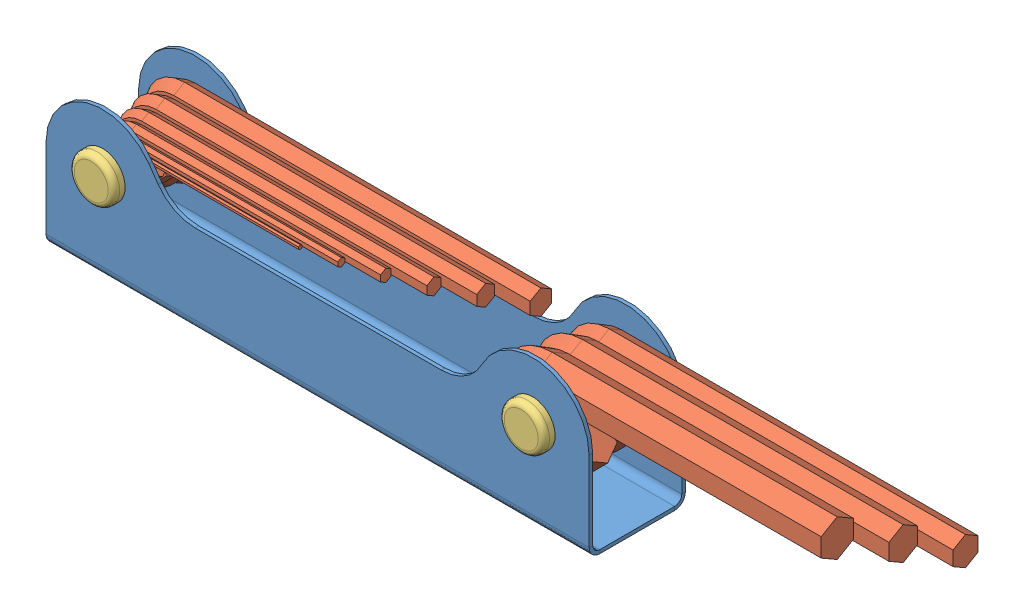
SolidWorks assembly part configs.SLDASM, configuration Default (file format 3100). Lengths in mm.
Overall size (236.53 41.27 38.17).
13 component instances, 4 part files, 27 mates.
Components (placement in the parent):
- Base Sheet Metal-1: Base Sheet Metal.SLDPRT [Default] at origin size (152.4 41.27 27)
- Allen Wrench-1: Allen Wrench.SLDPRT [Size 6] at (0 0 -9.5) size (110.93 21.86 6)
- Allen Wrench-2: Allen Wrench.SLDPRT [Size 5] at (0 0 -4) size (99.77 19.55 5)
- Allen Wrench-3: Allen Wrench.SLDPRT [Size 4] at (0 0 0.5) size (88.62 17.24 4)
- Allen Wrench-4: Allen Wrench.SLDPRT [Size3] at (0 0 4) size (77.46 14.93 3)
- Allen Wrench-5: Allen Wrench.SLDPRT [Size2] at (0 0 6.5) size (66.31 12.62 2)
- Allen Wrench-6: Allen Wrench.SLDPRT [Size1] at (0 0 8) size (55.15 10.31 1)
- Allen Wrench-7: Allen Wrench.SLDPRT [Size7] at (120.65 0 -8) size (112.08 24.17 7)
- Allen Wrench-8: Allen Wrench.SLDPRT [Size8] at (120.65 0 -0.5) size (103.24 26.48 8)
- Allen Wrench-9: Allen Wrench.SLDPRT [Size9] at (120.65 0 8) size (94.39 28.78 9)
- Pin-1: Pin.SLDPRT [Default] at (0 0 13.5) size (12.7 12.7 38.17)
- Pin-2: Pin.SLDPRT [Default] at (120.65 0 13.5) x (-0.979827 0.199848 0) z (0 0 1) size (12.7 12.7 38.17)
- Washer-1: Washer.SLDPRT [Default] at (0 0 10.5) size (25 25 2)
Mates (geometry in assembly coordinates):
- Coincident1: coincident aligned: plane of Base Sheet Metal-1; plane of assembly
- Coincident2: coincident aligned: plane of Base Sheet Metal-1; plane of assembly
- Coincident3: coincident aligned: plane of Base Sheet Metal-1; plane of assembly
- Coincident4: coincident aligned: axis of Base Sheet Metal-1; axis of Pin-1
- Coincident5: coincident anti-aligned: plane of Base Sheet Metal-1; plane of Pin-1
- Coincident6: coincident anti-aligned: axis of Base Sheet Metal-1; axis of Pin-2
- Coincident7: coincident anti-aligned: plane of Base Sheet Metal-1; plane of Pin-2
- Coincident8: coincident anti-aligned: axis of Pin-1; axis of Allen Wrench-1
- Coincident9: coincident anti-aligned: plane of Base Sheet Metal-1; plane of Allen Wrench-1
- Coincident10: coincident aligned: line of Allen Wrench-1; line of Allen Wrench-2
- Coincident11: coincident anti-aligned: plane of Allen Wrench-1; plane of Allen Wrench-2
- Coincident12: coincident aligned: line of Allen Wrench-2; line of Allen Wrench-3
- Coincident13: coincident anti-aligned: plane of Allen Wrench-2; plane of Allen Wrench-3
- Coincident14: coincident anti-aligned: plane of Allen Wrench-3; plane of Allen Wrench-4
- Coincident15: coincident aligned: line of Allen Wrench-2; line of Allen Wrench-4
- Coincident16: coincident aligned: line of Allen Wrench-4; axis of Washer-1
- Coincident17: coincident anti-aligned: plane of Base Sheet Metal-1; plane of Washer-1
- Coincident18: coincident aligned: line of Allen Wrench-3; line of Allen Wrench-5
- Coincident19: coincident anti-aligned: plane of Allen Wrench-4; plane of Allen Wrench-5
- Coincident20: coincident aligned: line of Allen Wrench-4; line of Allen Wrench-6
- Coincident21: coincident anti-aligned: plane of Allen Wrench-5; plane of Allen Wrench-6
- Coincident22: coincident anti-aligned: axis of Pin-2; axis of Allen Wrench-9
- Coincident23: coincident anti-aligned: plane of Base Sheet Metal-1; plane of Allen Wrench-9
- Coincident24: coincident anti-aligned: axis of Pin-2; axis of Allen Wrench-8
- Coincident25: coincident anti-aligned: plane of Allen Wrench-8; plane of Allen Wrench-9
- Coincident26: coincident anti-aligned: axis of Pin-2; axis of Allen Wrench-7
- Coincident27: coincident anti-aligned: plane of Allen Wrench-7; plane of Allen Wrench-8
